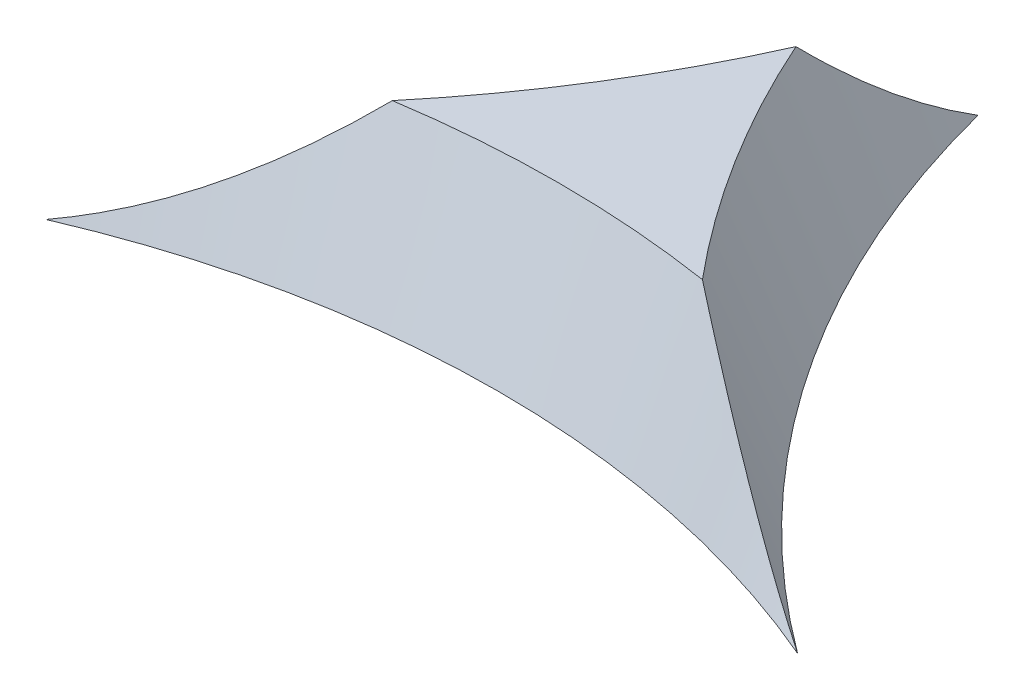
ISO-10303-21;
HEADER;
FILE_DESCRIPTION(('STEP AP214'),'2;1');
FILE_NAME('part.step','',(''),(''),'','','');
FILE_SCHEMA(('AUTOMOTIVE_DESIGN { 1 0 10303 214 1 1 1 1 }'));
ENDSEC;
DATA;
#1=APPLICATION_CONTEXT('core data for automotive mechanical design processes');
#2=APPLICATION_PROTOCOL_DEFINITION('international standard','automotive_design',2000,#1);
#3=PRODUCT_CONTEXT('',#1,'mechanical');
#4=PRODUCT('Part','Part','',(#3));
#5=PRODUCT_RELATED_PRODUCT_CATEGORY('part','',(#4));
#6=PRODUCT_DEFINITION_FORMATION('','',#4);
#7=PRODUCT_DEFINITION_CONTEXT('part definition',#1,'design');
#8=PRODUCT_DEFINITION('design','',#6,#7);
#9=PRODUCT_DEFINITION_SHAPE('','',#8);
#10=(LENGTH_UNIT() NAMED_UNIT(*) SI_UNIT(.MILLI.,.METRE.));
#11=(NAMED_UNIT(*) PLANE_ANGLE_UNIT() SI_UNIT($,.RADIAN.));
#12=(NAMED_UNIT(*) SI_UNIT($,.STERADIAN.) SOLID_ANGLE_UNIT());
#13=UNCERTAINTY_MEASURE_WITH_UNIT(LENGTH_MEASURE(1.E-05),#10,'distance_accuracy_value','');
#14=(GEOMETRIC_REPRESENTATION_CONTEXT(3) GLOBAL_UNCERTAINTY_ASSIGNED_CONTEXT((#13)) GLOBAL_UNIT_ASSIGNED_CONTEXT((#10,
#11,#12)) REPRESENTATION_CONTEXT('',''));
#15=CARTESIAN_POINT('',(0.,0.,0.));
#16=DIRECTION('',(0.,0.,1.));
#17=DIRECTION('',(1.,0.,0.));
#18=AXIS2_PLACEMENT_3D('',#15,#16,#17);
#19=CARTESIAN_POINT('',(-0.938154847,12.9,-8.719636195));
#20=DIRECTION('',(0.,-1.,0.));
#21=DIRECTION('',(0.,0.,-1.));
#22=AXIS2_PLACEMENT_3D('',#19,#20,#21);
#23=PLANE('',#22);
#24=CARTESIAN_POINT('',(5.8,12.9,-12.8));
#25=DIRECTION('',(0.,1.,0.));
#26=DIRECTION('',(0.,0.,1.));
#27=AXIS2_PLACEMENT_3D('',#24,#25,#26);
#28=CIRCLE('',#27,6.35);
#29=CARTESIAN_POINT('',(-5.7115076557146E-10,12.9,-10.2149468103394));
#30=VERTEX_POINT('',#29);
#31=CARTESIAN_POINT('',(0.927030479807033,12.9,-8.72855454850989));
#32=VERTEX_POINT('',#31);
#33=EDGE_CURVE('E26',#30,#32,#28,.T.);
#34=ORIENTED_EDGE('',*,*,#33,.F.);
#35=CARTESIAN_POINT('',(-5.8,12.9,-12.8));
#36=DIRECTION('',(0.,1.,0.));
#37=DIRECTION('',(0.,0.,1.));
#38=AXIS2_PLACEMENT_3D('',#35,#36,#37);
#39=CIRCLE('',#38,6.35);
#40=CARTESIAN_POINT('',(-0.927030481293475,12.9,-8.72855454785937));
#41=VERTEX_POINT('',#40);
#42=EDGE_CURVE('E11',#41,#30,#39,.T.);
#43=ORIENTED_EDGE('',*,*,#42,.F.);
#44=CARTESIAN_POINT('',(0.,12.9,-2.75));
#45=DIRECTION('',(0.,1.,0.));
#46=DIRECTION('',(0.,0.,1.));
#47=AXIS2_PLACEMENT_3D('',#44,#45,#46);
#48=CIRCLE('',#47,6.05);
#49=EDGE_CURVE('E69',#32,#41,#48,.T.);
#50=ORIENTED_EDGE('',*,*,#49,.F.);
#51=EDGE_LOOP('',(#34,#43,#50));
#52=FACE_BOUND('',#51,.T.);
#53=ADVANCED_FACE('F16',(#52),#23,.F.);
#54=CARTESIAN_POINT('',(-5.8,12.,-12.8));
#55=DIRECTION('',(0.,1.,0.));
#56=DIRECTION('',(0.,0.,1.));
#57=AXIS2_PLACEMENT_3D('',#54,#55,#56);
#58=CONICAL_SURFACE('',#57,5.99,0.380506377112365);
#59=CARTESIAN_POINT('',(0.,12.0000000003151,-11.3033036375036));
#60=CARTESIAN_POINT('',(3.8997462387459E-07,12.0283969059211,-11.2578470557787));
#61=CARTESIAN_POINT('',(3.65408241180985E-06,12.0576540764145,-11.212935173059));
#62=CARTESIAN_POINT('',(1.25503092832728E-05,12.1184931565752,-11.1230279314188));
#63=CARTESIAN_POINT('',(1.82408679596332E-05,12.1501153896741,-11.0780598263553));
#64=CARTESIAN_POINT('',(2.83599872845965E-05,12.215681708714,-10.9880059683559));
#65=CARTESIAN_POINT('',(3.27508912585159E-05,12.2496652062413,-10.9429489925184));
#66=CARTESIAN_POINT('',(3.86545366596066E-05,12.3199560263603,-10.8526820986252));
#67=CARTESIAN_POINT('',(4.00849209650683E-05,12.3563015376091,-10.8075019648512));
#68=CARTESIAN_POINT('',(3.96107678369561E-05,12.4313174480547,-10.7169556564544));
#69=CARTESIAN_POINT('',(3.76114587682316E-05,12.4700244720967,-10.6716198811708));
#70=CARTESIAN_POINT('',(3.10791451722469E-05,12.5497654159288,-10.5807305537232));
#71=CARTESIAN_POINT('',(2.64755253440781E-05,12.5908342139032,-10.5352076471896));
#72=CARTESIAN_POINT('',(1.65974166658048E-05,12.6752994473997,-10.4439135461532));
#73=CARTESIAN_POINT('',(1.13074315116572E-05,12.7187288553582,-10.3981729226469));
#74=CARTESIAN_POINT('',(3.00491909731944E-06,12.8079213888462,-10.3064154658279));
#75=CARTESIAN_POINT('',(6.26802373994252E-08,12.8537156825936,-10.2604289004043));
#76=CARTESIAN_POINT('',(-5.7113775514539E-10,12.8999999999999,-10.2149468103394));
#77=B_SPLINE_CURVE_WITH_KNOTS('',3,(#59,#60,#61,#62,#63,#64,#65,#66,#67,#68,#69,#70,#71,#72,#73,
#74,#75,#76),.UNSPECIFIED.,.F.,.F.,(4,2,2,2,2,2,2,2,4),(0.,0.160773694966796,0.325660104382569,
0.494938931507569,0.668866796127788,0.847678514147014,1.03158850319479,1.22079224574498,
1.41546775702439),.UNSPECIFIED.);
#78=CARTESIAN_POINT('',(0.,12.0000000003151,-11.3033036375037));
#79=VERTEX_POINT('',#78);
#80=EDGE_CURVE('E60',#79,#30,#77,.T.);
#81=ORIENTED_EDGE('',*,*,#80,.F.);
#82=CARTESIAN_POINT('',(-5.8,12.,-12.8));
#83=DIRECTION('',(0.,1.,0.));
#84=DIRECTION('',(0.,0.,1.));
#85=AXIS2_PLACEMENT_3D('',#82,#83,#84);
#86=CIRCLE('',#85,5.99);
#87=CARTESIAN_POINT('',(-2.24696839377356,12.0000000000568,-7.97754560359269));
#88=VERTEX_POINT('',#87);
#89=EDGE_CURVE('E64',#88,#79,#86,.T.);
#90=ORIENTED_EDGE('',*,*,#89,.F.);
#91=CARTESIAN_POINT('',(-0.927030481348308,12.8999999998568,-8.72855454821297));
#92=CARTESIAN_POINT('',(-0.977936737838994,12.8484525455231,-8.6997906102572));
#93=CARTESIAN_POINT('',(-1.02961486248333,12.7978976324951,-8.67056766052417));
#94=CARTESIAN_POINT('',(-1.13275034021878,12.7009578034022,-8.61219986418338));
#95=CARTESIAN_POINT('',(-1.18414825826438,12.6544882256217,-8.58309031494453));
#96=CARTESIAN_POINT('',(-1.28678896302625,12.5657104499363,-8.52491484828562));
#97=CARTESIAN_POINT('',(-1.33797406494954,12.5233134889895,-8.49588315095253));
#98=CARTESIAN_POINT('',(-1.44025718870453,12.4426877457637,-8.43782208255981));
#99=CARTESIAN_POINT('',(-1.4913007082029,12.4043669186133,-8.40882520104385));
#100=CARTESIAN_POINT('',(-1.57240638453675,12.3467712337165,-8.3627038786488));
#101=CARTESIAN_POINT('',(-1.60192753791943,12.3264682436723,-8.34590709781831));
#102=CARTESIAN_POINT('',(-1.66089297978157,12.2873033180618,-8.31233888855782));
#103=CARTESIAN_POINT('',(-1.69032701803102,12.2684206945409,-8.29557365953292));
#104=CARTESIAN_POINT('',(-1.74913344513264,12.2320975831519,-8.26206232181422));
#105=CARTESIAN_POINT('',(-1.77849634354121,12.2146364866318,-8.24532192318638));
#106=CARTESIAN_POINT('',(-1.83717572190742,12.1811559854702,-8.21185265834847));
#107=CARTESIAN_POINT('',(-1.86648358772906,12.1651163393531,-8.19512897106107));
#108=CARTESIAN_POINT('',(-1.92506787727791,12.1344783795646,-8.16168498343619));
#109=CARTESIAN_POINT('',(-1.95433666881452,12.1198604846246,-8.14496928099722));
#110=CARTESIAN_POINT('',(-2.0128574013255,12.0920651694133,-8.11153240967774));
#111=CARTESIAN_POINT('',(-2.04210277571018,12.0788691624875,-8.0948152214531));
#112=CARTESIAN_POINT('',(-2.10059157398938,12.0539168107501,-8.06136553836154));
#113=CARTESIAN_POINT('',(-2.12982953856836,12.0421432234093,-8.04463638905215));
#114=CARTESIAN_POINT('',(-2.18831610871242,12.0200331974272,-8.01115306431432));
#115=CARTESIAN_POINT('',(-2.21756039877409,12.0096812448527,-7.99440158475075));
#116=CARTESIAN_POINT('',(-2.24696839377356,12.0000000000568,-7.97754560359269));
#117=B_SPLINE_CURVE_WITH_KNOTS('',3,(#91,#92,#93,#94,#95,#96,#97,#98,#99,#100,#101,#102,#103,
#104,#105,#106,#107,#108,#109,#110,#111,#112,#113,#114,#115,#116),.UNSPECIFIED.,.F.,.F.,(4,2,2,
2,2,2,2,2,2,2,2,2,4),(0.,0.233858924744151,0.459271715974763,0.676785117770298,
0.887013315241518,1.00570988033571,1.12203476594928,1.23614550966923,1.3482094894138,
1.45840394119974,1.56691582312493,1.6739415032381,1.77968625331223),.UNSPECIFIED.);
#118=EDGE_CURVE('E79',#41,#88,#117,.T.);
#119=ORIENTED_EDGE('',*,*,#118,.F.);
#120=ORIENTED_EDGE('',*,*,#42,.T.);
#121=EDGE_LOOP('',(#81,#90,#119,#120));
#122=FACE_BOUND('',#121,.T.);
#123=ADVANCED_FACE('F63',(#122),#58,.F.);
#124=CARTESIAN_POINT('',(5.8,12.,-12.8));
#125=DIRECTION('',(0.,1.,0.));
#126=DIRECTION('',(0.,0.,1.));
#127=AXIS2_PLACEMENT_3D('',#124,#125,#126);
#128=CONICAL_SURFACE('',#127,5.99,0.380506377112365);
#129=CARTESIAN_POINT('',(2.2469683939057,12.0000000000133,-7.97754560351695));
#130=CARTESIAN_POINT('',(2.21772045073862,12.0096285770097,-7.99430985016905));
#131=CARTESIAN_POINT('',(2.18863449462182,12.0199207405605,-8.01097078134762));
#132=CARTESIAN_POINT('',(2.13046375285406,12.0418967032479,-8.04427378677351));
#133=CARTESIAN_POINT('',(2.10138322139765,12.0535958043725,-8.06091320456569));
#134=CARTESIAN_POINT('',(2.04320864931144,12.0783847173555,-8.09418398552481));
#135=CARTESIAN_POINT('',(2.01411998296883,12.0914915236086,-8.11081205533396));
#136=CARTESIAN_POINT('',(1.95591227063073,12.1190940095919,-8.14407103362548));
#137=CARTESIAN_POINT('',(1.92679968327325,12.1336080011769,-8.16069802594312));
#138=CARTESIAN_POINT('',(1.86852764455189,12.1640237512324,-8.19396474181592));
#139=CARTESIAN_POINT('',(1.83937569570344,12.1799447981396,-8.21059994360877));
#140=CARTESIAN_POINT('',(1.78100822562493,12.2131737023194,-8.24389220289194));
#141=CARTESIAN_POINT('',(1.75180116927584,12.2305014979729,-8.26054416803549));
#142=CARTESIAN_POINT('',(1.69330676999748,12.2665436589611,-8.29387844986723));
#143=CARTESIAN_POINT('',(1.66402875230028,12.2852783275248,-8.31055515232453));
#144=CARTESIAN_POINT('',(1.60537581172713,12.3241328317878,-8.34394593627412));
#145=CARTESIAN_POINT('',(1.57601095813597,12.344273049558,-8.36065392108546));
#146=CARTESIAN_POINT('',(1.49474337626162,12.4018226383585,-8.40686794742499));
#147=CARTESIAN_POINT('',(1.44339367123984,12.4402860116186,-8.43603913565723));
#148=CARTESIAN_POINT('',(1.34049384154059,12.5212488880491,-8.49445148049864));
#149=CARTESIAN_POINT('',(1.28899930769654,12.5638424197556,-8.52365952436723));
#150=CARTESIAN_POINT('',(1.18573339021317,12.6530651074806,-8.58219102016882));
#151=CARTESIAN_POINT('',(1.13402085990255,12.6997849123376,-8.61147956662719));
#152=CARTESIAN_POINT('',(1.03024827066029,12.7972774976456,-8.67020918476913));
#153=CARTESIAN_POINT('',(0.97824885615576,12.8481367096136,-8.699614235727));
#154=CARTESIAN_POINT('',(0.927030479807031,12.8999999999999,-8.72855454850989));
#155=B_SPLINE_CURVE_WITH_KNOTS('',3,(#129,#130,#131,#132,#133,#134,#135,#136,#137,#138,#139,
#140,#141,#142,#143,#144,#145,#146,#147,#148,#149,#150,#151,#152,#153,#154),.UNSPECIFIED.,.F.,
.F.,(4,2,2,2,2,2,2,2,2,2,2,2,4),(0.,0.105169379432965,0.211608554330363,0.319519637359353,
0.429096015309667,0.540521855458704,0.653971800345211,0.769610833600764,0.887594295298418,
1.09893941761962,1.31766304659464,1.54439233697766,1.77968512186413),.UNSPECIFIED.);
#156=CARTESIAN_POINT('',(2.24696839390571,12.0000000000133,-7.97754560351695));
#157=VERTEX_POINT('',#156);
#158=EDGE_CURVE('E83',#157,#32,#155,.T.);
#159=ORIENTED_EDGE('',*,*,#158,.F.);
#160=CARTESIAN_POINT('',(5.8,12.,-12.8));
#161=DIRECTION('',(0.,1.,0.));
#162=DIRECTION('',(0.,0.,1.));
#163=AXIS2_PLACEMENT_3D('',#160,#161,#162);
#164=CIRCLE('',#163,5.99);
#165=EDGE_CURVE('E75',#79,#157,#164,.T.);
#166=ORIENTED_EDGE('',*,*,#165,.F.);
#167=ORIENTED_EDGE('',*,*,#80,.T.);
#168=ORIENTED_EDGE('',*,*,#33,.T.);
#169=EDGE_LOOP('',(#159,#166,#167,#168));
#170=FACE_BOUND('',#169,.T.);
#171=ADVANCED_FACE('F81',(#170),#128,.F.);
#172=CARTESIAN_POINT('',(0.,12.,-2.75));
#173=DIRECTION('',(0.,1.,0.));
#174=DIRECTION('',(0.,0.,1.));
#175=AXIS2_PLACEMENT_3D('',#172,#173,#174);
#176=CONICAL_SURFACE('',#175,5.69,0.380506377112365);
#177=ORIENTED_EDGE('',*,*,#118,.T.);
#178=CARTESIAN_POINT('',(0.,12.,-2.75));
#179=DIRECTION('',(0.,1.,0.));
#180=DIRECTION('',(0.,0.,1.));
#181=AXIS2_PLACEMENT_3D('',#178,#179,#180);
#182=CIRCLE('',#181,5.69);
#183=EDGE_CURVE('E77',#157,#88,#182,.T.);
#184=ORIENTED_EDGE('',*,*,#183,.F.);
#185=ORIENTED_EDGE('',*,*,#158,.T.);
#186=ORIENTED_EDGE('',*,*,#49,.T.);
#187=EDGE_LOOP('',(#177,#184,#185,#186));
#188=FACE_BOUND('',#187,.T.);
#189=ADVANCED_FACE('F108',(#188),#176,.F.);
#190=CARTESIAN_POINT('',(-2.273932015,12.,-7.957591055));
#191=DIRECTION('',(0.,-1.,0.));
#192=DIRECTION('',(0.,0.,-1.));
#193=AXIS2_PLACEMENT_3D('',#190,#191,#192);
#194=PLANE('',#193);
#195=ORIENTED_EDGE('',*,*,#165,.T.);
#196=ORIENTED_EDGE('',*,*,#183,.T.);
#197=ORIENTED_EDGE('',*,*,#89,.T.);
#198=EDGE_LOOP('',(#195,#196,#197));
#199=FACE_BOUND('',#198,.T.);
#200=ADVANCED_FACE('F74',(#199),#194,.T.);
#201=CLOSED_SHELL('',(#53,#123,#171,#189,#200));
#202=MANIFOLD_SOLID_BREP('B1',#201);
#203=ADVANCED_BREP_SHAPE_REPRESENTATION('',(#18,#202),#14);
#204=SHAPE_DEFINITION_REPRESENTATION(#9,#203);
ENDSEC;
END-ISO-10303-21;
